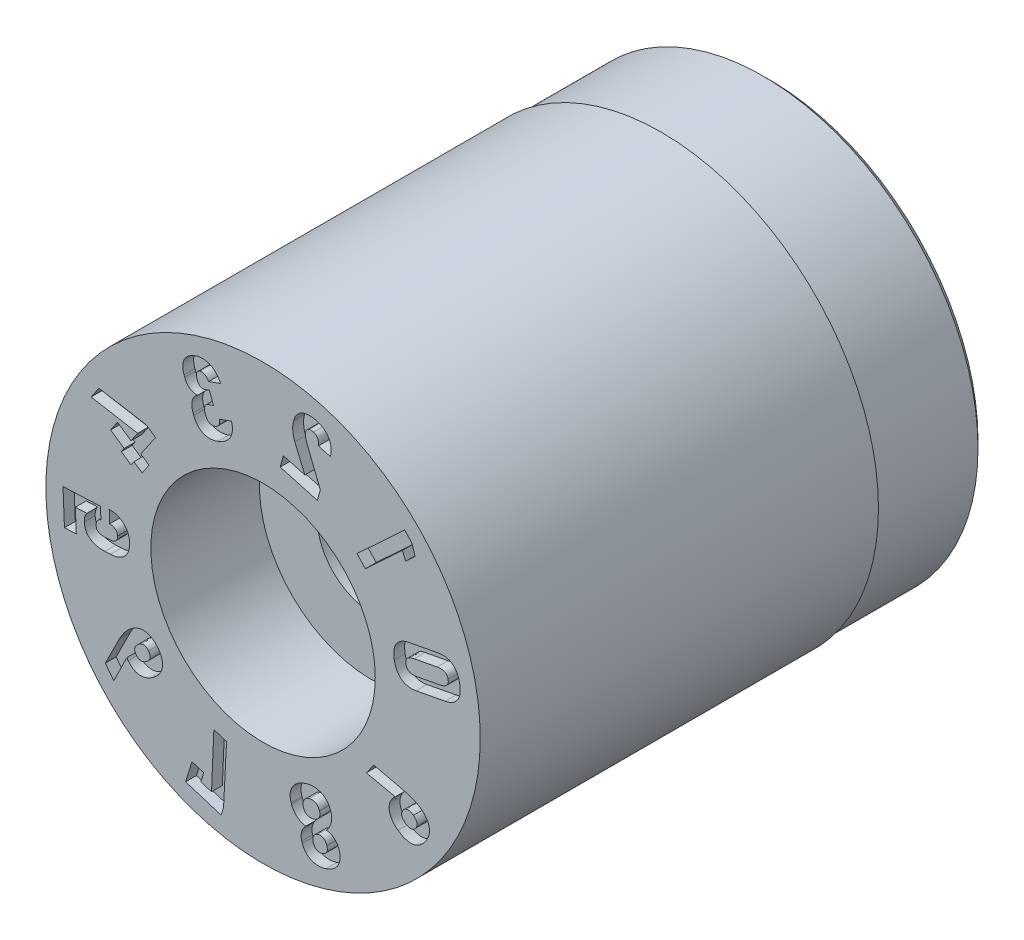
from build123d import *

# Parameters (mm, degrees)
SKETCH4_W          = 3
SKETCH4_H          = 1
CUT_EXTRUDE1_DEPTH = 0.3


with BuildPart() as part:
    # Sketch1 → Revolve1 (revolve)
    with BuildSketch(Plane(origin=(0, 0, 0), x_dir=(0, 0, -1), z_dir=(1, 0, 0)), mode=Mode.PRIVATE) as revolve1_sk:
        Polygon((0, 6), (0, 3.1), (3, 3.1), (3, 1.5), (14, 1.5), (14, 5.75), (13.75, 6), align=None)
    revolve(revolve1_sk.sketch.rotate(Axis((0, 0, 3.797909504), (0, 0, -1)), 90), axis=Axis((0, 0, 3.797909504), (0, 0, -1)))

    # Sketch4 → Cut-Revolve1 (revolve, cut)
    with BuildSketch(Plane(origin=(0, 0, 0), x_dir=(0, 0, -1), z_dir=(1, 0, 0)), mode=Mode.PRIVATE) as cut_revolve1_sk:
        with Locations((12.5, 6.435)):
            Rectangle(SKETCH4_W, SKETCH4_H)
    revolve(cut_revolve1_sk.sketch.rotate(Axis((0, 0, 0), (0, 0, -1)), 90), axis=Axis((0, 0, 0), (0, 0, -1)), mode=Mode.SUBTRACT)

    # Sketch5 → Cut-Extrude1 (cut)
    # profile 1 of 10: a face of its own
    with BuildSketch(Plane.XY):
        with BuildLine():
            Line((4.226990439, 0.249260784), (5.03045264, 0.40048911))
            add(Edge.make_bspline(
                [(5.03045264, 0.40048911), (5.068082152, 0.407590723), (5.122494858, 0.421735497), (5.19035172, 0.448997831), (5.23558102, 0.473036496), (5.276803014, 0.500617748), (5.314021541, 0.531620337), (5.347056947, 0.566479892), (5.375756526, 0.604943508), (5.400072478, 0.646750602), (5.419314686, 0.691717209), (5.433967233, 0.739525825), (5.443564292, 0.7905049), (5.448489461, 0.84461898), (5.447746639, 0.922991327), (5.440318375, 0.982918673), (5.432747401, 1.023437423)],
                knots=[0, 0, 0, 0, 0.135991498, 0.198956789, 0.259278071, 0.317535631, 0.374792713, 0.430927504, 0.487676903, 0.544841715, 0.60225663, 0.660981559, 0.722057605, 0.786137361, 0.853628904, 1, 1, 1, 1], degree=3))
            add(Edge.make_bspline(
                [(5.432747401, 1.023437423), (5.425536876, 1.064249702), (5.409980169, 1.122711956), (5.382368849, 1.196186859), (5.358219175, 1.244782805), (5.330777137, 1.288816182), (5.300029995, 1.328433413), (5.265435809, 1.363005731), (5.227947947, 1.393308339), (5.187262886, 1.418387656), (5.143918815, 1.438659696), (5.098225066, 1.454630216), (5.049561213, 1.46474981), (4.998508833, 1.470183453), (4.925044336, 1.472157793), (4.86899857, 1.464394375), (4.831160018, 1.457721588)],
                knots=[0, 0, 0, 0, 0.146861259, 0.214086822, 0.278090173, 0.338994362, 0.397858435, 0.455547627, 0.512085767, 0.568467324, 0.624609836, 0.681530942, 0.739750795, 0.800470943, 0.863458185, 1, 1, 1, 1], degree=3))
            Line((4.831160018, 1.457721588), (4.027697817, 1.306493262))
            add(Edge.make_bspline(
                [(4.027697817, 1.306493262), (3.99014266, 1.299210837), (3.93551602, 1.285580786), (3.867981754, 1.257528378), (3.822691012, 1.233633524), (3.781484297, 1.206015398), (3.744261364, 1.175022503), (3.711228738, 1.140159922), (3.682522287, 1.101698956), (3.658231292, 1.059884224), (3.638856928, 1.014857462), (3.624557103, 0.966841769), (3.61481844, 0.915801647), (3.609987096, 0.861791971), (3.610406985, 0.783536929), (3.618044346, 0.723721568), (3.625536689, 0.683203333)],
                knots=[0, 0, 0, 0, 0.135999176, 0.198975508, 0.259300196, 0.317561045, 0.374821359, 0.43095932, 0.487711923, 0.544879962, 0.602298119, 0.661367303, 0.722446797, 0.786530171, 0.85362064, 1, 1, 1, 1], degree=3))
            add(Edge.make_bspline(
                [(3.625536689, 0.683203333), (3.632939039, 0.642467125), (3.647982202, 0.58367071), (3.676479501, 0.510414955), (3.700436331, 0.461570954), (3.728329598, 0.417714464), (3.759493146, 0.378397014), (3.793944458, 0.343427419), (3.832236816, 0.313800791), (3.873186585, 0.288654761), (3.916849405, 0.268692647), (3.962570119, 0.25254457), (4.011051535, 0.242681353), (4.061769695, 0.236513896), (4.134386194, 0.235691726), (4.189787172, 0.242086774), (4.226990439, 0.249260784)],
                knots=[0, 0, 0, 0, 0.147080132, 0.214838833, 0.27893757, 0.340014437, 0.399092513, 0.45686768, 0.513928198, 0.570655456, 0.62718115, 0.684187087, 0.742493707, 0.802536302, 0.86545121, 1, 1, 1, 1], degree=3))
        make_face()
        with BuildLine():
            Line((4.175755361, 0.989426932), (4.808948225, 1.108711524))
            add(Edge.make_bspline(
                [(4.808948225, 1.108711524), (4.847077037, 1.115254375), (4.902525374, 1.122172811), (4.972137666, 1.113702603), (5.008735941, 1.102537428), (5.033850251, 1.089134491), (5.050852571, 1.077584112), (5.065896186, 1.063539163), (5.078733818, 1.047264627), (5.090299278, 1.029378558), (5.103114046, 1.001656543), (5.109279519, 0.978870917), (5.112125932, 0.96300839)],
                knots=[0, 0, 0, 0, 0.304250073, 0.431921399, 0.546901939, 0.601209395, 0.654313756, 0.707409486, 0.761607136, 0.816242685, 0.873810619, 1, 1, 1, 1], degree=3))
            add(Edge.make_bspline(
                [(5.112125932, 0.96300839), (5.11568536, 0.947276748), (5.117220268, 0.923836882), (5.116103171, 0.893250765), (5.111844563, 0.872356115), (5.105700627, 0.852527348), (5.096673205, 0.834198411), (5.085502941, 0.816823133), (5.066246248, 0.795657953), (5.036451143, 0.771620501), (4.974575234, 0.738363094), (4.920422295, 0.724943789), (4.88252873, 0.717213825)],
                knots=[0, 0, 0, 0, 0.125601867, 0.183416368, 0.238903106, 0.291960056, 0.345455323, 0.398296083, 0.453076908, 0.568682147, 0.696043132, 1, 1, 1, 1], degree=3))
            Line((4.88252873, 0.717213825), (4.249335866, 0.597929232))
            add(Edge.make_bspline(
                [(4.249335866, 0.597929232), (4.211264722, 0.590545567), (4.155762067, 0.584621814), (4.086153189, 0.592919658), (4.049532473, 0.604089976), (4.024459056, 0.617531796), (4.007380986, 0.628930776), (3.992896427, 0.643307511), (3.97981102, 0.659296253), (3.968420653, 0.677318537), (3.955479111, 0.705094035), (3.949363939, 0.727916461), (3.946499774, 0.743766)],
                knots=[0, 0, 0, 0, 0.304439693, 0.432145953, 0.547157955, 0.60148027, 0.654599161, 0.707302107, 0.760601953, 0.816192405, 0.873776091, 1, 1, 1, 1], degree=3))
            add(Edge.make_bspline(
                [(3.946499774, 0.743766), (3.942943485, 0.759496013), (3.941399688, 0.782940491), (3.942530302, 0.813519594), (3.946753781, 0.834432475), (3.952995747, 0.85411124), (3.961547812, 0.872696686), (3.973122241, 0.889699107), (3.991963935, 0.91116953), (4.021819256, 0.935087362), (4.084044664, 0.967487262), (4.137635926, 0.982283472), (4.175755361, 0.989426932)],
                knots=[0, 0, 0, 0, 0.125715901, 0.183582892, 0.239120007, 0.292225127, 0.345070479, 0.398742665, 0.45272165, 0.568431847, 0.695789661, 1, 1, 1, 1], degree=3))
        make_face(mode=Mode.SUBTRACT)
    # profile 2 of 10: a face of its own
    with BuildSketch(Plane.XY):
        Polygon((2.595284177, 2.715177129), (2.825709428, 2.467261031), (3.850915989, 3.419968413), (3.939072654, 3.203102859), (4.202778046, 3.448183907), (4.108893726, 3.727262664), (3.91221339, 3.938860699), align=None)
    # profile 3 of 10: a face of its own
    with BuildSketch(Plane.XY):
        with BuildLine():
            Line((1.581907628, 3.733793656), (1.20414815, 4.681419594))
            add(Edge.make_bspline(
                [(1.20414815, 4.681419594), (1.188191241, 4.721573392), (1.173411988, 4.773631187), (1.169156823, 4.836261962), (1.169342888, 4.872985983), (1.173183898, 4.899540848), (1.177959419, 4.916211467)],
                knots=[0, 0, 0, 0, 0.541521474, 0.666578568, 0.78372083, 1, 1, 1, 1], degree=3))
            Line((1.177959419, 4.916211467), (1.178658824, 4.918788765))
            add(Edge.make_bspline(
                [(1.178658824, 4.918788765), (1.184703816, 4.939734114), (1.197817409, 4.969908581), (1.227900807, 4.999709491), (1.25420601, 5.01528963), (1.284227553, 5.025476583), (1.33177808, 5.030048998), (1.368777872, 5.023715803), (1.393650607, 5.016499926)],
                knots=[0, 0, 0, 0, 0.245859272, 0.357439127, 0.468909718, 0.585493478, 0.709548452, 1, 1, 1, 1], degree=3))
            add(Edge.make_bspline(
                [(1.393650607, 5.016499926), (1.418355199, 5.009262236), (1.454235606, 4.993733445), (1.490847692, 4.958408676), (1.511311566, 4.927030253), (1.526332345, 4.891195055), (1.536290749, 4.834616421), (1.534635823, 4.78990225), (1.528987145, 4.759502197)],
                knots=[0, 0, 0, 0, 0.240984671, 0.354134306, 0.468631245, 0.587400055, 0.713051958, 1, 1, 1, 1], degree=3))
            Line((1.528987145, 4.759502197), (1.528542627, 4.758056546))
            Line((1.528542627, 4.758056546), (1.863585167, 4.664995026))
            Line((1.863585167, 4.664995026), (1.864029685, 4.666440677))
            add(Edge.make_bspline(
                [(1.864029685, 4.666440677), (1.87516401, 4.718269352), (1.883566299, 4.795663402), (1.878473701, 4.896861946), (1.865070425, 4.966682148), (1.844066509, 5.032314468), (1.814630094, 5.092782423), (1.777310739, 5.147986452), (1.731828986, 5.197148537), (1.679520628, 5.240753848), (1.598955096, 5.291719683), (1.530618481, 5.317537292), (1.483255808, 5.330917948)],
                knots=[0, 0, 0, 0, 0.185673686, 0.271385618, 0.354245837, 0.434158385, 0.512263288, 0.589164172, 0.666876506, 0.746221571, 0.827243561, 1, 1, 1, 1], degree=3))
            add(Edge.make_bspline(
                [(1.483255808, 5.330917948), (1.43292102, 5.344800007), (1.358010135, 5.360261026), (1.259501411, 5.362742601), (1.192181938, 5.356727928), (1.129573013, 5.342014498), (1.071431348, 5.320071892), (1.019161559, 5.288783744), (0.971885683, 5.250241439), (0.93064656, 5.203705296), (0.882012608, 5.129885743), (0.857851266, 5.066010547), (0.845217, 5.021596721)],
                knots=[0, 0, 0, 0, 0.194817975, 0.282960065, 0.366323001, 0.445889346, 0.521879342, 0.596881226, 0.671801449, 0.748278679, 0.827604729, 1, 1, 1, 1], degree=3))
            Line((0.845217, 5.021596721), (0.844772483, 5.02015107))
            add(Edge.make_bspline(
                [(0.844772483, 5.02015107), (0.8337397, 4.980790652), (0.823147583, 4.919964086), (0.817991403, 4.837339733), (0.820233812, 4.774322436), (0.827292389, 4.711658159), (0.842139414, 4.629626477), (0.861846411, 4.570370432), (0.877406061, 4.532065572)],
                knots=[0, 0, 0, 0, 0.24601194, 0.37092605, 0.498250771, 0.62543257, 0.750687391, 1, 1, 1, 1], degree=3))
            Line((0.877406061, 4.532065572), (1.154398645, 3.874554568))
            Line((1.154398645, 3.874554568), (0.561756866, 4.039191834))
            Line((0.561756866, 4.039191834), (0.474414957, 3.724264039))
            Line((0.474414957, 3.724264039), (1.499971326, 3.439170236))
            Line((1.499971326, 3.439170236), (1.581907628, 3.733793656))
        make_face()
    # profile 4 of 10: a face of its own
    with BuildSketch(Plane.XY):
        with BuildLine():
            Line((-0.872255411, 4.150052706), (-1.203119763, 4.03154124))
            add(Edge.make_bspline(
                [(-1.203119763, 4.03154124), (-1.198737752, 4.014188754), (-1.19665452, 3.988245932), (-1.197318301, 3.954272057), (-1.20127178, 3.930740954), (-1.207827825, 3.908502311), (-1.217164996, 3.887939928), (-1.229085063, 3.869142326), (-1.243051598, 3.8518503), (-1.259503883, 3.836255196), (-1.285905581, 3.818591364), (-1.307232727, 3.806970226), (-1.323068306, 3.801946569)],
                knots=[0, 0, 0, 0, 0.186457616, 0.271753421, 0.355241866, 0.4355155, 0.513981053, 0.590926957, 0.668032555, 0.746320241, 0.82725516, 1, 1, 1, 1], degree=3))
            add(Edge.make_bspline(
                [(-1.323068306, 3.801946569), (-1.3503957, 3.792423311), (-1.392188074, 3.782742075), (-1.446709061, 3.788584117), (-1.482766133, 3.80113757), (-1.515112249, 3.821694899), (-1.55336958, 3.861801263), (-1.57300276, 3.900205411), (-1.582821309, 3.927974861)],
                knots=[0, 0, 0, 0, 0.266171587, 0.383198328, 0.497106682, 0.612378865, 0.730214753, 1, 1, 1, 1], degree=3))
            Line((-1.582821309, 3.927974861), (-1.597151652, 3.967949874))
            add(Edge.make_bspline(
                [(-1.597151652, 3.967949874), (-1.607628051, 3.996658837), (-1.618754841, 4.039492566), (-1.618993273, 4.095424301), (-1.612089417, 4.131403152), (-1.597816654, 4.163084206), (-1.569243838, 4.200454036), (-1.536700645, 4.217258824), (-1.514582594, 4.225702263)],
                knots=[0, 0, 0, 0, 0.300023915, 0.427576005, 0.545015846, 0.655861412, 0.765084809, 1, 1, 1, 1], degree=3))
            Line((-1.514582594, 4.225702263), (-1.370362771, 4.277261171))
            Line((-1.370362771, 4.277261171), (-1.480853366, 4.586229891))
            Line((-1.480853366, 4.586229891), (-1.625073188, 4.534670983))
            add(Edge.make_bspline(
                [(-1.625073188, 4.534670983), (-1.643447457, 4.527908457), (-1.672789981, 4.523646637), (-1.71078397, 4.532197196), (-1.736560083, 4.546604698), (-1.760319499, 4.567073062), (-1.790856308, 4.604467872), (-1.806134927, 4.639577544), (-1.815147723, 4.664303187)],
                knots=[0, 0, 0, 0, 0.226283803, 0.333188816, 0.444788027, 0.564051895, 0.694140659, 1, 1, 1, 1], degree=3))
            Line((-1.815147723, 4.664303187), (-1.82560934, 4.693213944))
            add(Edge.make_bspline(
                [(-1.82560934, 4.693213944), (-1.833490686, 4.716706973), (-1.843027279, 4.751796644), (-1.841028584, 4.797847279), (-1.833179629, 4.827592), (-1.819374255, 4.85399919), (-1.792717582, 4.885663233), (-1.763556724, 4.899765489), (-1.743904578, 4.907526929)],
                knots=[0, 0, 0, 0, 0.287752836, 0.411590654, 0.527861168, 0.639744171, 0.752926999, 1, 1, 1, 1], degree=3))
            add(Edge.make_bspline(
                [(-1.743904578, 4.907526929), (-1.730065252, 4.912493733), (-1.70837072, 4.917647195), (-1.678896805, 4.916948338), (-1.656868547, 4.91399789), (-1.635237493, 4.907045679), (-1.613833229, 4.89813982), (-1.593210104, 4.885599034), (-1.573131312, 4.870454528), (-1.554017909, 4.852079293), (-1.528377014, 4.823667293), (-1.512794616, 4.798422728), (-1.502424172, 4.781202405)],
                knots=[0, 0, 0, 0, 0.148721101, 0.22134778, 0.29641438, 0.371995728, 0.449758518, 0.5297193, 0.614659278, 0.702909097, 0.796696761, 1, 1, 1, 1], degree=3))
            Line((-1.502424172, 4.781202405), (-1.172642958, 4.899298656))
            add(Edge.make_bspline(
                [(-1.172642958, 4.899298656), (-1.194763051, 4.946724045), (-1.232896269, 5.014115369), (-1.298513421, 5.090488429), (-1.350651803, 5.139057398), (-1.407753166, 5.17831403), (-1.467259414, 5.210417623), (-1.530434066, 5.232264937), (-1.595661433, 5.246361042), (-1.662847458, 5.251707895), (-1.754769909, 5.246000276), (-1.822906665, 5.23027406), (-1.866907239, 5.213811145)],
                knots=[0, 0, 0, 0, 0.185937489, 0.272262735, 0.35635393, 0.437911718, 0.517414, 0.595439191, 0.674146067, 0.753590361, 0.833658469, 1, 1, 1, 1], degree=3))
            add(Edge.make_bspline(
                [(-1.866907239, 5.213811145), (-1.902679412, 5.201232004), (-1.953596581, 5.179319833), (-2.016042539, 5.143439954), (-2.056942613, 5.114680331), (-2.093495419, 5.083295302), (-2.125524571, 5.049579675), (-2.152850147, 5.013108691), (-2.175656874, 4.974539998), (-2.193773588, 4.933814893), (-2.207310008, 4.89135898), (-2.214968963, 4.847018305), (-2.218562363, 4.801242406), (-2.216759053, 4.753893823), (-2.207329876, 4.686848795), (-2.192942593, 4.63675392), (-2.1813104, 4.603196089)],
                knots=[0, 0, 0, 0, 0.145510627, 0.212085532, 0.276075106, 0.337093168, 0.396692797, 0.454167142, 0.511616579, 0.568276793, 0.624892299, 0.6821517, 0.740564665, 0.800818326, 0.863591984, 1, 1, 1, 1], degree=3))
            Line((-2.1813104, 4.603196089), (-2.162645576, 4.551589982))
            add(Edge.make_bspline(
                [(-2.162645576, 4.551589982), (-2.149337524, 4.51437314), (-2.123286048, 4.461193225), (-2.072778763, 4.402572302), (-2.030348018, 4.365543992), (-1.982184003, 4.33632316), (-1.910840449, 4.306645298), (-1.852343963, 4.297930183), (-1.812806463, 4.29685643)],
                knots=[0, 0, 0, 0, 0.25724486, 0.37872459, 0.500357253, 0.621364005, 0.742820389, 1, 1, 1, 1], degree=3))
            add(Edge.make_bspline(
                [(-1.812806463, 4.29685643), (-1.830948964, 4.285256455), (-1.856615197, 4.26601114), (-1.885982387, 4.235787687), (-1.905815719, 4.212300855), (-1.922175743, 4.186572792), (-1.936664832, 4.159609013), (-1.947793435, 4.130607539), (-1.957186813, 4.100380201), (-1.963504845, 4.068702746), (-1.967677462, 4.03606572), (-1.968343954, 4.002247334), (-1.966940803, 3.967580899), (-1.962433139, 3.931971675), (-1.952651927, 3.882230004), (-1.941373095, 3.845024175), (-1.932445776, 3.820161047)],
                knots=[0, 0, 0, 0, 0.120839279, 0.17875033, 0.236020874, 0.292821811, 0.349349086, 0.407341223, 0.466659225, 0.526611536, 0.588187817, 0.650868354, 0.715990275, 0.782550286, 0.851866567, 1, 1, 1, 1], degree=3))
            Line((-1.932445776, 3.820161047), (-1.914064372, 3.768322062))
            add(Edge.make_bspline(
                [(-1.914064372, 3.768322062), (-1.897095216, 3.722453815), (-1.867241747, 3.656860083), (-1.811748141, 3.581808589), (-1.765986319, 3.535350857), (-1.715521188, 3.496773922), (-1.659918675, 3.467325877), (-1.599824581, 3.446847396), (-1.535551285, 3.435211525), (-1.467660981, 3.43247183), (-1.369448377, 3.440702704), (-1.295987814, 3.461596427), (-1.246822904, 3.478607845)],
                knots=[0, 0, 0, 0, 0.177849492, 0.259154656, 0.337577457, 0.413780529, 0.488774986, 0.564883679, 0.643292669, 0.724994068, 0.810790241, 1, 1, 1, 1], degree=3))
            add(Edge.make_bspline(
                [(-1.246822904, 3.478607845), (-1.197780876, 3.495730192), (-1.128336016, 3.528431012), (-1.045175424, 3.584465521), (-0.991358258, 3.631395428), (-0.945385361, 3.68342495), (-0.907285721, 3.7398824), (-0.878079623, 3.800878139), (-0.857198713, 3.865625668), (-0.845919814, 3.933782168), (-0.843666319, 4.030065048), (-0.858042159, 4.102526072), (-0.872255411, 4.150052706)],
                knots=[0, 0, 0, 0, 0.181189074, 0.266469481, 0.349308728, 0.429719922, 0.508169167, 0.586269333, 0.664996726, 0.74485554, 0.826563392, 1, 1, 1, 1], degree=3))
        make_face()
    # profile 5 of 10: a face of its own
    with BuildSketch(Plane.XY):
        Polygon((-3.227706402, 2.885031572), (-4.534734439, 3.104945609), (-4.749297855, 2.789222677), (-3.462915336, 2.564634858), (-3.646300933, 2.294618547), (-4.021497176, 2.549339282), (-4.211083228, 2.270027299), (-3.835964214, 2.015358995), (-3.914836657, 1.899227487), (-3.645801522, 1.716602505), (-3.566958, 1.832730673), (-3.338437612, 1.677588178), (-3.14885156, 1.95690016), (-3.377338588, 2.112020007), (-2.970990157, 2.710528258), align=None)
    # profile 6 of 10: a face of its own
    with BuildSketch(Plane.XY):
        with BuildLine():
            Line((-4.248421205, 0.352362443), (-4.249517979, 0.352272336))
            Line((-4.249517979, 0.352272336), (-4.235262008, 0.012989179))
            Line((-4.235262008, 0.012989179), (-4.234165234, 0.013079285))
            add(Edge.make_bspline(
                [(-4.234165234, 0.013079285), (-4.204040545, 0.011261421), (-4.160476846, 0.004142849), (-4.108611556, -0.018215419), (-4.076872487, -0.039770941), (-4.051110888, -0.06626497), (-4.025004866, -0.108596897), (-4.017582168, -0.146040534), (-4.01660059, -0.171110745)],
                knots=[0, 0, 0, 0, 0.286676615, 0.413246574, 0.532743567, 0.648079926, 0.761103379, 1, 1, 1, 1], degree=3))
            add(Edge.make_bspline(
                [(-4.01660059, -0.171110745), (-4.016150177, -0.197704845), (-4.019191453, -0.238317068), (-4.043843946, -0.284301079), (-4.068461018, -0.313070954), (-4.10037203, -0.336111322), (-4.154428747, -0.35940806), (-4.200232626, -0.36593182), (-4.231990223, -0.367314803)],
                knots=[0, 0, 0, 0, 0.24461929, 0.356445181, 0.468733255, 0.585858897, 0.710532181, 1, 1, 1, 1], degree=3))
            Line((-4.231990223, -0.367314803), (-4.382728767, -0.373809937))
            add(Edge.make_bspline(
                [(-4.382728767, -0.373809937), (-4.414303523, -0.374871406), (-4.460228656, -0.373437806), (-4.515566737, -0.356119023), (-4.549005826, -0.33827492), (-4.575659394, -0.31468359), (-4.603248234, -0.275935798), (-4.609881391, -0.239725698), (-4.611382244, -0.215926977)],
                knots=[0, 0, 0, 0, 0.303264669, 0.432107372, 0.550998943, 0.662524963, 0.769301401, 1, 1, 1, 1], degree=3))
            add(Edge.make_bspline(
                [(-4.611382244, -0.215926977), (-4.612687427, -0.193139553), (-4.609506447, -0.159365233), (-4.595299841, -0.117538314), (-4.580259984, -0.089585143), (-4.560602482, -0.064971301), (-4.528844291, -0.035966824), (-4.499097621, -0.021648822), (-4.478510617, -0.014356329)],
                knots=[0, 0, 0, 0, 0.262806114, 0.385849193, 0.507005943, 0.626637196, 0.74726016, 1, 1, 1, 1], degree=3))
            Line((-4.478510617, -0.014356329), (-4.491665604, 0.302565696))
            Line((-4.491665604, 0.302565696), (-5.526422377, 0.259512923))
            Line((-5.526422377, 0.259512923), (-5.486001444, -0.707369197))
            Line((-5.486001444, -0.707369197), (-5.159178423, -0.693768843))
            Line((-5.159178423, -0.693768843), (-5.185343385, -0.066169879))
            Line((-5.185343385, -0.066169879), (-4.867324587, -0.052924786))
            add(Edge.make_bspline(
                [(-4.867324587, -0.052924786), (-4.879969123, -0.066902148), (-4.895399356, -0.091767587), (-4.91206439, -0.128494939), (-4.932767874, -0.191491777), (-4.939467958, -0.247747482), (-4.937821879, -0.292433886)],
                knots=[0, 0, 0, 0, 0.220737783, 0.342483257, 0.474000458, 1, 1, 1, 1], degree=3))
            add(Edge.make_bspline(
                [(-4.937821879, -0.292433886), (-4.936233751, -0.336120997), (-4.926686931, -0.400309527), (-4.895439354, -0.478607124), (-4.864876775, -0.530446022), (-4.826617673, -0.576364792), (-4.780720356, -0.615611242), (-4.728119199, -0.648881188), (-4.668288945, -0.675159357), (-4.601984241, -0.69499557), (-4.501707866, -0.712994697), (-4.422659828, -0.714972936), (-4.368502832, -0.712727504)],
                knots=[0, 0, 0, 0, 0.163690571, 0.23976732, 0.314001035, 0.387833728, 0.462201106, 0.538927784, 0.619758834, 0.705772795, 0.797168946, 1, 1, 1, 1], degree=3))
            Line((-4.368502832, -0.712727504), (-4.217764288, -0.706232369))
            add(Edge.make_bspline(
                [(-4.217764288, -0.706232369), (-4.163588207, -0.703887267), (-4.084413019, -0.694682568), (-3.986507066, -0.663276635), (-3.92205739, -0.63333167), (-3.864707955, -0.596260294), (-3.814830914, -0.551933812), (-3.773148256, -0.500444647), (-3.738898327, -0.44261711), (-3.71272614, -0.378504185), (-3.688802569, -0.281828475), (-3.685605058, -0.204887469), (-3.687608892, -0.152547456)],
                knots=[0, 0, 0, 0, 0.187027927, 0.272197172, 0.353057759, 0.431043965, 0.506488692, 0.581820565, 0.658217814, 0.737109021, 0.819387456, 1, 1, 1, 1], degree=3))
            add(Edge.make_bspline(
                [(-3.687608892, -0.152547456), (-3.689664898, -0.106360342), (-3.699333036, -0.037828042), (-3.730690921, 0.047309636), (-3.760753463, 0.106323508), (-3.798845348, 0.160009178), (-3.844009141, 0.20813711), (-3.896708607, 0.24957161), (-3.955645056, 0.285496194), (-4.021156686, 0.313676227), (-4.118110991, 0.342975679), (-4.19568256, 0.350690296), (-4.248421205, 0.352362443)],
                knots=[0, 0, 0, 0, 0.165245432, 0.244423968, 0.322863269, 0.400913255, 0.478529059, 0.557552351, 0.639420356, 0.724146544, 0.811331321, 1, 1, 1, 1], degree=3))
        make_face()
    # profile 7 of 10: a face of its own
    with BuildSketch(Plane.XY):
        with BuildLine():
            Line((-3.658053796, -2.21130249), (-3.659028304, -2.212196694))
            add(Edge.make_bspline(
                [(-3.659028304, -2.212196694), (-3.685277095, -2.233246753), (-3.724064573, -2.266972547), (-3.772000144, -2.317437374), (-3.845608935, -2.402625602), (-3.898998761, -2.481667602), (-3.937009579, -2.548185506)],
                knots=[0, 0, 0, 0, 0.230206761, 0.350844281, 0.475765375, 1, 1, 1, 1], degree=3))
            add(Edge.make_bspline(
                [(-3.937009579, -2.548185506), (-3.943810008, -2.559642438), (-3.956586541, -2.582851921), (-3.968776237, -2.606379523), (-3.97422884, -2.618376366)],
                knots=[0, 0, 0, 0, 0.50280701, 1, 1, 1, 1], degree=3))
            Line((-3.97422884, -2.618376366), (-4.358313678, -3.38421955))
            Line((-4.358313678, -3.38421955), (-4.121502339, -3.686237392))
            Line((-4.121502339, -3.686237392), (-3.761819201, -2.951823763))
            add(Edge.make_bspline(
                [(-3.761819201, -2.951823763), (-3.751895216, -2.971365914), (-3.739430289, -2.989655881), (-3.726161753, -3.006997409)],
                knots=[0.759339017, 0.759339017, 0.759339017, 0.759339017, 1, 1, 1, 1], degree=3))
            add(Edge.make_bspline(
                [(-3.726161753, -3.006997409), (-3.697650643, -3.043419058), (-3.650383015, -3.092779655), (-3.57696944, -3.142329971), (-3.520559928, -3.169270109), (-3.461756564, -3.186765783), (-3.400884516, -3.194745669), (-3.33838464, -3.193138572), (-3.274402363, -3.182018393), (-3.209552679, -3.161155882), (-3.118840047, -3.120265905), (-3.054713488, -3.077299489), (-3.013260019, -3.044617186)],
                knots=[0, 0, 0, 0, 0.171399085, 0.2504333, 0.32667763, 0.401892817, 0.476561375, 0.552972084, 0.632426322, 0.716098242, 0.804456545, 1, 1, 1, 1], degree=3))
            add(Edge.make_bspline(
                [(-3.013260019, -3.044617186), (-2.970485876, -3.010379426), (-2.912083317, -2.956879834), (-2.850791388, -2.874904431), (-2.816112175, -2.813179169), (-2.791338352, -2.749707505), (-2.776233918, -2.684946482), (-2.772575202, -2.619102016), (-2.77887308, -2.552655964), (-2.795414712, -2.486009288), (-2.83186803, -2.394300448), (-2.873599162, -2.330399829), (-2.905639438, -2.289575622)],
                knots=[0, 0, 0, 0, 0.187277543, 0.27231383, 0.353593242, 0.431766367, 0.507592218, 0.582942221, 0.659158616, 0.73796712, 0.819995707, 1, 1, 1, 1], degree=3))
            add(Edge.make_bspline(
                [(-2.905639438, -2.289575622), (-2.937590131, -2.249090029), (-2.989255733, -2.193267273), (-3.069517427, -2.136490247), (-3.130013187, -2.104267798), (-3.192633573, -2.081868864), (-3.257140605, -2.069870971), (-3.322978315, -2.068341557), (-3.389902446, -2.076910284), (-3.457470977, -2.095439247), (-3.550667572, -2.135150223), (-3.615850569, -2.178658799), (-3.658053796, -2.21130249)],
                knots=[0, 0, 0, 0, 0.180297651, 0.262843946, 0.341995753, 0.4187428, 0.493946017, 0.569924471, 0.647567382, 0.728532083, 0.813597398, 1, 1, 1, 1], degree=3))
        make_face()
        with BuildLine():
            Line((-3.205400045, -2.763744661), (-3.206374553, -2.764638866))
            add(Edge.make_bspline(
                [(-3.206374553, -2.764638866), (-3.232698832, -2.784463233), (-3.272669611, -2.811579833), (-3.33101982, -2.829254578), (-3.371034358, -2.833702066), (-3.409341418, -2.828685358), (-3.458317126, -2.809151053), (-3.487983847, -2.781060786), (-3.50470825, -2.759883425)],
                knots=[0, 0, 0, 0, 0.294267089, 0.420155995, 0.537434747, 0.648668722, 0.759224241, 1, 1, 1, 1], degree=3))
            add(Edge.make_bspline(
                [(-3.50470825, -2.759883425), (-3.52190262, -2.738858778), (-3.540578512, -2.702920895), (-3.548082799, -2.650772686), (-3.543351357, -2.612314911), (-3.529421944, -2.57423776), (-3.498140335, -2.521880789), (-3.462734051, -2.48921767), (-3.437108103, -2.468642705)],
                knots=[0, 0, 0, 0, 0.240463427, 0.349973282, 0.462515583, 0.580197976, 0.707082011, 1, 1, 1, 1], degree=3))
            Line((-3.437108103, -2.468642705), (-3.436220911, -2.46810478))
            add(Edge.make_bspline(
                [(-3.436220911, -2.46810478), (-3.413428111, -2.450601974), (-3.377848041, -2.428003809), (-3.325794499, -2.414279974), (-3.289231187, -2.413317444), (-3.253726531, -2.420335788), (-3.207313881, -2.442108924), (-3.179108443, -2.470456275), (-3.162445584, -2.491390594)],
                knots=[0, 0, 0, 0, 0.2773018, 0.397050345, 0.512682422, 0.625484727, 0.741527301, 1, 1, 1, 1], degree=3))
            add(Edge.make_bspline(
                [(-3.162445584, -2.491390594), (-3.146089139, -2.512633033), (-3.125019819, -2.546880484), (-3.115385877, -2.597419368), (-3.11692768, -2.633634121), (-3.126911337, -2.668990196), (-3.152232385, -2.71658175), (-3.183030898, -2.745748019), (-3.205400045, -2.763744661)],
                knots=[0, 0, 0, 0, 0.258673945, 0.374449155, 0.487862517, 0.602639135, 0.723306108, 1, 1, 1, 1], degree=3))
        make_face(mode=Mode.SUBTRACT)
    # profile 8 of 10: a face of its own
    with BuildSketch(Plane.XY):
        Polygon((-1.091304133, -5.203496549), (-1.008170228, -3.581801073), (-1.358869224, -3.472540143), (-1.423788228, -4.993592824), (-1.718806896, -4.901818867), (-1.638003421, -4.643354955), (-1.961570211, -4.54257167), (-2.139507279, -5.112858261), (-1.158478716, -5.418326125), align=None)
    # profile 9 of 10: a face of its own
    with BuildSketch(Plane.XY):
        with BuildLine():
            Line((0.776240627, -4.155455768), (0.785432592, -4.183815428))
            add(Edge.make_bspline(
                [(0.785432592, -4.183815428), (0.799189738, -4.226061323), (0.829541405, -4.286224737), (0.885424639, -4.356806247), (0.935676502, -4.403603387), (0.991268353, -4.444020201), (1.07172572, -4.486667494), (1.13745979, -4.505542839), (1.182357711, -4.511312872)],
                knots=[0, 0, 0, 0, 0.245704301, 0.369762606, 0.497087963, 0.62501582, 0.749576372, 1, 1, 1, 1], degree=3))
            add(Edge.make_bspline(
                [(1.182357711, -4.511312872), (1.154690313, -4.538142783), (1.118147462, -4.583453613), (1.083793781, -4.652280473), (1.065102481, -4.706292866), (1.053726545, -4.761489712), (1.048966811, -4.834634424), (1.058409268, -4.88868426), (1.069535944, -4.922833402)],
                knots=[0, 0, 0, 0, 0.257544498, 0.384666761, 0.512218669, 0.638321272, 0.76005738, 1, 1, 1, 1], degree=3))
            Line((1.069535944, -4.922833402), (1.084670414, -4.967799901))
            add(Edge.make_bspline(
                [(1.084670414, -4.967799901), (1.099307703, -5.010028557), (1.126034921, -5.071499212), (1.179766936, -5.140611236), (1.225000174, -5.185002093), (1.275762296, -5.222217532), (1.332097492, -5.250515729), (1.392476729, -5.272198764), (1.457504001, -5.284329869), (1.525584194, -5.28939397), (1.622254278, -5.283131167), (1.694649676, -5.266442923), (1.742534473, -5.250378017)],
                knots=[0, 0, 0, 0, 0.166991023, 0.246209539, 0.324565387, 0.402311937, 0.479468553, 0.558503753, 0.640353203, 0.72493188, 0.812048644, 1, 1, 1, 1], degree=3))
            add(Edge.make_bspline(
                [(1.742534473, -5.250378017), (1.790450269, -5.234577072), (1.858789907, -5.205074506), (1.940095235, -5.152109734), (1.991977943, -5.107487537), (2.036550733, -5.058742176), (2.072407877, -5.005670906), (2.100270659, -4.949216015), (2.11898303, -4.889194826), (2.129055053, -4.826727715), (2.129840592, -4.739254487), (2.116258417, -4.673832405), (2.102268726, -4.631151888)],
                knots=[0, 0, 0, 0, 0.187872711, 0.275417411, 0.360294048, 0.441980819, 0.520586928, 0.597953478, 0.675532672, 0.753756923, 0.832693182, 1, 1, 1, 1], degree=3))
            Line((2.102268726, -4.631151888), (2.087134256, -4.586185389))
            add(Edge.make_bspline(
                [(2.087134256, -4.586185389), (2.075313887, -4.551789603), (2.050913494, -4.501758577), (2.002438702, -4.445673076), (1.959924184, -4.408081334), (1.91213803, -4.376222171), (1.842758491, -4.342638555), (1.786297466, -4.328527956), (1.747951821, -4.324091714)],
                knots=[0, 0, 0, 0, 0.241889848, 0.363901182, 0.489969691, 0.617557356, 0.743886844, 1, 1, 1, 1], degree=3))
            add(Edge.make_bspline(
                [(1.747951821, -4.324091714), (1.780202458, -4.291904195), (1.822756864, -4.237614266), (1.862293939, -4.15497609), (1.883601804, -4.08946259), (1.896530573, -4.022094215), (1.89951242, -3.932143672), (1.888889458, -3.865658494), (1.874152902, -3.823564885)],
                knots=[0, 0, 0, 0, 0.251846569, 0.376945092, 0.504401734, 0.63155546, 0.754571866, 1, 1, 1, 1], degree=3))
            Line((1.874152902, -3.823564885), (1.864960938, -3.795205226))
            add(Edge.make_bspline(
                [(1.864960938, -3.795205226), (1.850309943, -3.749894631), (1.820117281, -3.686049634), (1.764455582, -3.612028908), (1.716035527, -3.565582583), (1.661557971, -3.527023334), (1.60191273, -3.496419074), (1.537183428, -3.474661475), (1.467897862, -3.46147543), (1.395058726, -3.456891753), (1.291477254, -3.462682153), (1.214034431, -3.481530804), (1.16277339, -3.49849167)],
                knots=[0, 0, 0, 0, 0.166423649, 0.244684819, 0.322720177, 0.400072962, 0.47733586, 0.556336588, 0.638060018, 0.723313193, 0.810961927, 1, 1, 1, 1], degree=3))
            add(Edge.make_bspline(
                [(1.16277339, -3.49849167), (1.111519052, -3.515700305), (1.038108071, -3.546832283), (0.951173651, -3.603480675), (0.895659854, -3.65080352), (0.847683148, -3.702456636), (0.809107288, -3.758752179), (0.779253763, -3.818752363), (0.759416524, -3.882335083), (0.7480754, -3.948482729), (0.746988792, -4.04109145), (0.761165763, -4.11038632), (0.776240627, -4.155455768)],
                knots=[0, 0, 0, 0, 0.189267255, 0.277092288, 0.361955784, 0.443820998, 0.522942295, 0.599834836, 0.67734458, 0.755080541, 0.833778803, 1, 1, 1, 1], degree=3))
        make_face()
        with BuildLine():
            Line((1.556950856, -3.94959749), (1.56238014, -3.966128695))
            add(Edge.make_bspline(
                [(1.56238014, -3.966128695), (1.568631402, -3.984419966), (1.574030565, -4.012513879), (1.573886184, -4.050110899), (1.569004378, -4.076913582), (1.560356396, -4.102679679), (1.548519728, -4.127158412), (1.532619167, -4.149833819), (1.513995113, -4.171330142), (1.491153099, -4.190075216), (1.456551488, -4.213715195), (1.42647597, -4.225695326), (1.40588646, -4.232779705)],
                knots=[0, 0, 0, 0, 0.166557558, 0.244876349, 0.323273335, 0.400575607, 0.478937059, 0.557042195, 0.639016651, 0.723619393, 0.811325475, 1, 1, 1, 1], degree=3))
            add(Edge.make_bspline(
                [(1.40588646, -4.232779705), (1.385048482, -4.239398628), (1.353730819, -4.247563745), (1.311800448, -4.249562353), (1.282323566, -4.247754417), (1.254301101, -4.242079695), (1.228129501, -4.232830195), (1.203522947, -4.220781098), (1.181675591, -4.204254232), (1.161381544, -4.185636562), (1.138828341, -4.155350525), (1.126023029, -4.129774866), (1.120445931, -4.111271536)],
                knots=[0, 0, 0, 0, 0.188608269, 0.275831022, 0.360138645, 0.442070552, 0.520835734, 0.598447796, 0.676627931, 0.755652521, 0.834544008, 1, 1, 1, 1], degree=3))
            Line((1.120445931, -4.111271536), (1.114435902, -4.093343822))
            add(Edge.make_bspline(
                [(1.114435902, -4.093343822), (1.107968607, -4.073595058), (1.10113453, -4.043382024), (1.101442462, -4.002866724), (1.105402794, -3.973914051), (1.113161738, -3.946116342), (1.12453529, -3.919951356), (1.140302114, -3.895945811), (1.15923572, -3.87371123), (1.181380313, -3.853476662), (1.216051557, -3.82997296), (1.245092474, -3.816480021), (1.265794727, -3.809942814)],
                knots=[0, 0, 0, 0, 0.173050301, 0.25432676, 0.335507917, 0.415168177, 0.493423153, 0.571546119, 0.65287336, 0.735566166, 0.819945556, 1, 1, 1, 1], degree=3))
            add(Edge.make_bspline(
                [(1.265794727, -3.809942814), (1.286390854, -3.803213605), (1.317786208, -3.796084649), (1.359789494, -3.795214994), (1.389716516, -3.797792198), (1.418276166, -3.80483881), (1.445337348, -3.814869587), (1.470232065, -3.82934343), (1.493123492, -3.847065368), (1.513302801, -3.868399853), (1.53786102, -3.900966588), (1.550218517, -3.929760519), (1.556950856, -3.94959749)],
                knots=[0, 0, 0, 0, 0.179374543, 0.263495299, 0.346503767, 0.426861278, 0.505924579, 0.584221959, 0.66390936, 0.744387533, 0.826249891, 1, 1, 1, 1], degree=3))
        make_face(mode=Mode.SUBTRACT)
        with BuildLine():
            Line((1.759435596, -4.680257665), (1.764864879, -4.69678887))
            add(Edge.make_bspline(
                [(1.764864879, -4.69678887), (1.770216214, -4.7140138), (1.77632323, -4.740061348), (1.776946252, -4.77487514), (1.774219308, -4.799530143), (1.767897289, -4.823004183), (1.758093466, -4.845032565), (1.745717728, -4.865836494), (1.729841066, -4.884924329), (1.711110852, -4.901920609), (1.682018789, -4.922400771), (1.656816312, -4.932793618), (1.639513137, -4.938926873)],
                knots=[0, 0, 0, 0, 0.176555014, 0.258727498, 0.338977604, 0.418046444, 0.49506001, 0.573776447, 0.653706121, 0.73651809, 0.820135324, 1, 1, 1, 1], degree=3))
            add(Edge.make_bspline(
                [(1.639513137, -4.938926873), (1.622035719, -4.944431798), (1.595524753, -4.951302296), (1.560030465, -4.951413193), (1.534820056, -4.949357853), (1.510794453, -4.943365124), (1.488245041, -4.934315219), (1.467576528, -4.921843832), (1.448359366, -4.906662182), (1.431205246, -4.888315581), (1.410736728, -4.859874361), (1.399496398, -4.835519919), (1.394052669, -4.818329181)],
                knots=[0, 0, 0, 0, 0.17938548, 0.263015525, 0.34481901, 0.425187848, 0.503219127, 0.580638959, 0.659511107, 0.741062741, 0.824446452, 1, 1, 1, 1], degree=3))
            Line((1.394052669, -4.818329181), (1.388261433, -4.800695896))
            add(Edge.make_bspline(
                [(1.388261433, -4.800695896), (1.382462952, -4.782675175), (1.376027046, -4.755436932), (1.374851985, -4.718859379), (1.377366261, -4.692880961), (1.383074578, -4.667963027), (1.392043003, -4.644516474), (1.404500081, -4.622852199), (1.420246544, -4.60316537), (1.438190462, -4.584810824), (1.467440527, -4.564275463), (1.492024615, -4.552612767), (1.509556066, -4.546948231)],
                knots=[0, 0, 0, 0, 0.179804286, 0.263110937, 0.346021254, 0.426637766, 0.504807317, 0.583217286, 0.662539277, 0.743380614, 0.825713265, 1, 1, 1, 1], degree=3))
            add(Edge.make_bspline(
                [(1.509556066, -4.546948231), (1.526921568, -4.540848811), (1.553694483, -4.535433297), (1.589497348, -4.534697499), (1.615002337, -4.538366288), (1.639407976, -4.544935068), (1.66227974, -4.555351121), (1.683719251, -4.568735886), (1.703540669, -4.585378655), (1.720847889, -4.605308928), (1.74173252, -4.636009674), (1.753242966, -4.662010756), (1.759435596, -4.680257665)],
                knots=[0, 0, 0, 0, 0.172755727, 0.255120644, 0.335641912, 0.414326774, 0.492081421, 0.571110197, 0.65145877, 0.734559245, 0.81859373, 1, 1, 1, 1], degree=3))
        make_face(mode=Mode.SUBTRACT)
    # profile 10 of 10: a face of its own
    with BuildSketch(Plane.XY):
        with BuildLine():
            Line((3.72844954, -3.337723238), (3.729490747, -3.338538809))
            add(Edge.make_bspline(
                [(3.729490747, -3.338538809), (3.773403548, -3.369665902), (3.840507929, -3.411517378), (3.936137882, -3.44714888), (4.00459227, -3.463684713), (4.0720871, -3.469963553), (4.138068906, -3.466451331), (4.202085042, -3.452170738), (4.264041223, -3.428308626), (4.323182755, -3.394066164), (4.400873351, -3.334009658), (4.450480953, -3.276422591), (4.48083273, -3.234626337)],
                knots=[0, 0, 0, 0, 0.187729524, 0.272774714, 0.35413044, 0.43205911, 0.507805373, 0.583072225, 0.659321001, 0.737916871, 0.819993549, 1, 1, 1, 1], degree=3))
            add(Edge.make_bspline(
                [(4.48083273, -3.234626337), (4.511054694, -3.193047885), (4.549282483, -3.127843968), (4.581856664, -3.035418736), (4.595151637, -2.968112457), (4.598268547, -2.901482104), (4.590625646, -2.835926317), (4.573463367, -2.771665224), (4.545527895, -2.709201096), (4.507993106, -2.648871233), (4.442801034, -2.569261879), (4.382369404, -2.517380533), (4.338284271, -2.485587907)],
                knots=[0, 0, 0, 0, 0.178139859, 0.259721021, 0.338422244, 0.414964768, 0.489810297, 0.566168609, 0.644475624, 0.725942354, 0.811607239, 1, 1, 1, 1], degree=3))
            add(Edge.make_bspline(
                [(4.338284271, -2.485587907), (4.312528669, -2.466207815), (4.271007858, -2.44208658), (4.212686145, -2.412346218), (4.164441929, -2.391666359), (4.11276758, -2.372684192), (4.038372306, -2.346681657), (3.980003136, -2.330749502), (3.940275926, -2.319735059)],
                knots=[0, 0, 0, 0, 0.217345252, 0.332435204, 0.453732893, 0.58096115, 0.714055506, 1, 1, 1, 1], degree=3))
            add(Edge.make_bspline(
                [(3.940275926, -2.319735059), (3.928333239, -2.316613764), (3.905088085, -2.309480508), (3.881324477, -2.304294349), (3.869576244, -2.302092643)],
                knots=[0, 0, 0, 0, 0.508014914, 1, 1, 1, 1], degree=3))
            Line((3.869576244, -2.302092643), (3.060429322, -2.112210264))
            Line((3.060429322, -2.112210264), (2.851448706, -2.401610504))
            Line((2.851448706, -2.401610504), (3.652507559, -2.57515279))
            add(Edge.make_bspline(
                [(3.652507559, -2.57515279), (3.65126647, -2.5760897), (3.640436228, -2.584418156), (3.610510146, -2.611438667), (3.584907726, -2.640586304), (3.569640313, -2.662405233)],
                knots=[0.564869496, 0.564869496, 0.564869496, 0.564869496, 0.581682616, 0.712592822, 1, 1, 1, 1], degree=3))
            add(Edge.make_bspline(
                [(3.569640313, -2.662405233), (3.544012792, -2.696928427), (3.513664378, -2.753165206), (3.489416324, -2.833327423), (3.481505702, -2.89370116), (3.481930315, -2.954243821), (3.491775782, -3.014422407), (3.510207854, -3.073868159), (3.537776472, -3.132014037), (3.573423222, -3.188361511), (3.633278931, -3.261640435), (3.688808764, -3.308575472), (3.72844954, -3.337723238)],
                knots=[0, 0, 0, 0, 0.165094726, 0.243502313, 0.320907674, 0.39840014, 0.475565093, 0.55458947, 0.637016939, 0.722338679, 0.810468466, 1, 1, 1, 1], degree=3))
        make_face()
        with BuildLine():
            Line((4.152760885, -2.767644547), (4.153802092, -2.768460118))
            add(Edge.make_bspline(
                [(4.153802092, -2.768460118), (4.177900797, -2.786316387), (4.211091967, -2.81530895), (4.240288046, -2.86301914), (4.25311048, -2.898510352), (4.256848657, -2.935129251), (4.250059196, -2.986018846), (4.230914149, -3.021087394), (4.215617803, -3.042780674)],
                knots=[0, 0, 0, 0, 0.283483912, 0.406122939, 0.522197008, 0.635111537, 0.74868477, 1, 1, 1, 1], degree=3))
            add(Edge.make_bspline(
                [(4.215617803, -3.042780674), (4.200031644, -3.064823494), (4.171885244, -3.093305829), (4.125545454, -3.116239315), (4.089354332, -3.123471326), (4.051435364, -3.123034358), (3.996828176, -3.109777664), (3.958715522, -3.087683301), (3.934223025, -3.070236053)],
                knots=[0, 0, 0, 0, 0.252807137, 0.365840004, 0.478594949, 0.59466356, 0.717809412, 1, 1, 1, 1], degree=3))
            Line((3.934223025, -3.070236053), (3.933181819, -3.069420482))
            add(Edge.make_bspline(
                [(3.933181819, -3.069420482), (3.908547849, -3.050646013), (3.873214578, -3.021569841), (3.843219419, -2.972275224), (3.829729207, -2.936167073), (3.825357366, -2.899080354), (3.83156442, -2.847564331), (3.85030781, -2.811847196), (3.866278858, -2.790210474)],
                knots=[0, 0, 0, 0, 0.287594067, 0.411199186, 0.527112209, 0.639623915, 0.751345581, 1, 1, 1, 1], degree=3))
            add(Edge.make_bspline(
                [(3.866278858, -2.790210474), (3.881715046, -2.768320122), (3.910091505, -2.740106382), (3.956743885, -2.717844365), (3.993462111, -2.71057574), (4.032149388, -2.712328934), (4.088171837, -2.726544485), (4.127409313, -2.749668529), (4.152760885, -2.767644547)],
                knots=[0, 0, 0, 0, 0.246903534, 0.359132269, 0.471361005, 0.587799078, 0.712696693, 1, 1, 1, 1], degree=3))
        make_face(mode=Mode.SUBTRACT)
    extrude(amount=-CUT_EXTRUDE1_DEPTH, mode=Mode.SUBTRACT)


solid = part.part
